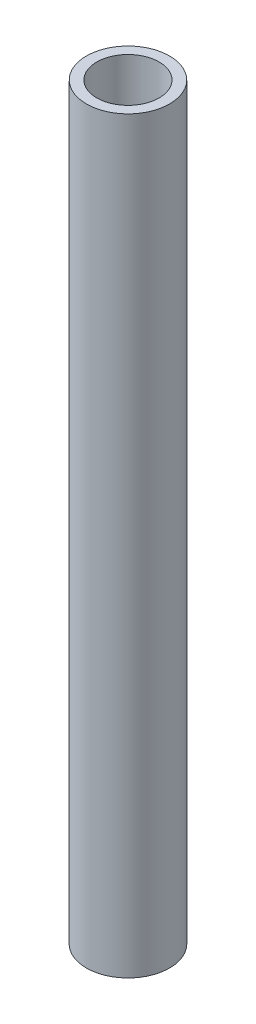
from build123d import *

# Parameters (mm, degrees)
SKETCH2_R           = 25.4
SKETCH2_R_2         = 19.05
BOSS_EXTRUDE1_DEPTH = 457.2


with BuildPart() as part:
    # Sketch2 → Boss-Extrude1 (new body)
    with BuildSketch(Plane(origin=(0, 0, 0), x_dir=(1, 0, 0), z_dir=(0, 1, 0))):
        with Locations(Location((0, 0, 0), (0, 0, 270))):
            Circle(SKETCH2_R)
        with Locations(Location((0, 0, 0), (0, 0, 270))):
            Circle(SKETCH2_R_2, mode=Mode.SUBTRACT)
    extrude(amount=BOSS_EXTRUDE1_DEPTH)


solid = part.part
